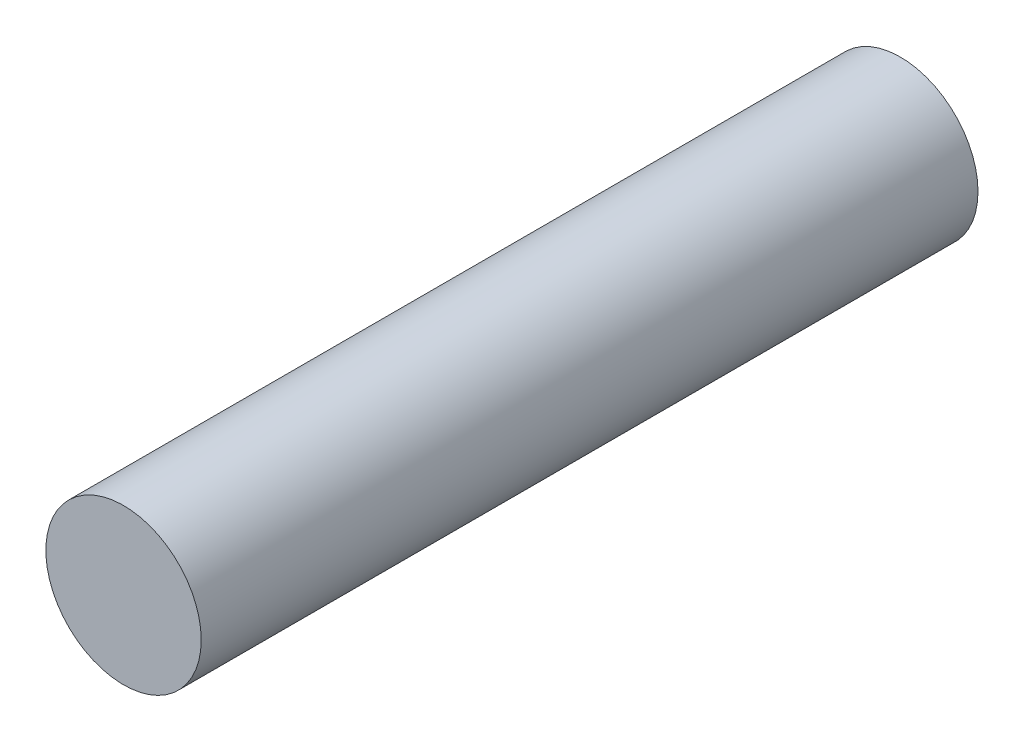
from build123d import *

# Parameters (mm, degrees)
SKETCH1_R          = 1.27
BASE_EXTRUDE_DEPTH = 12.7


with BuildPart() as part:
    # Sketch1 → Base-Extrude (new body)
    with BuildSketch(Plane.XY):
        Circle(SKETCH1_R)
    extrude(amount=BASE_EXTRUDE_DEPTH)


solid = part.part
